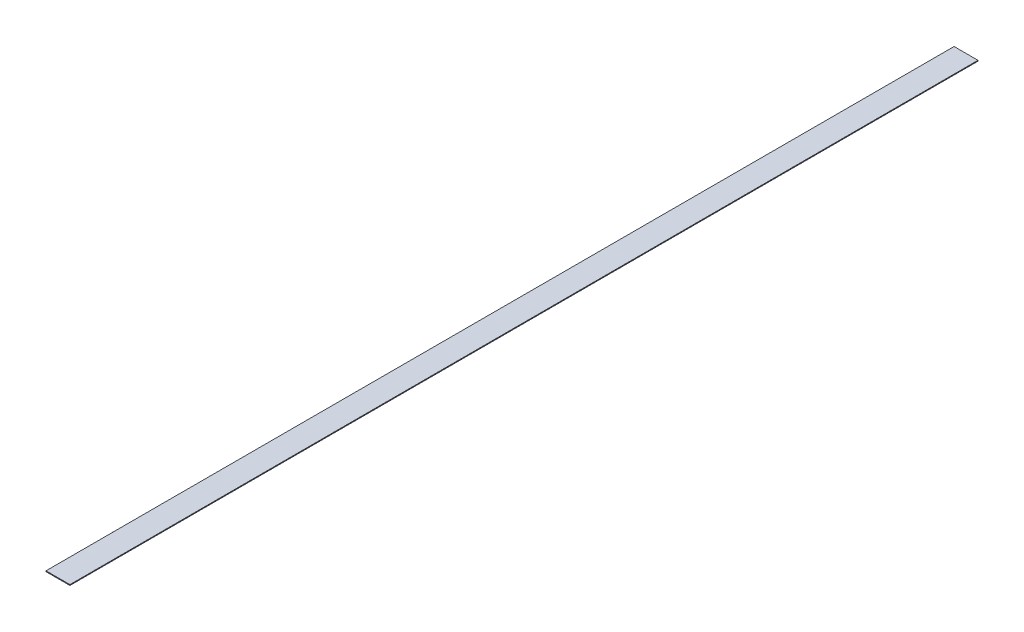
ISO-10303-21;
HEADER;
FILE_DESCRIPTION(('STEP AP214'),'2;1');
FILE_NAME('part.step','',(''),(''),'','','');
FILE_SCHEMA(('AUTOMOTIVE_DESIGN { 1 0 10303 214 1 1 1 1 }'));
ENDSEC;
DATA;
#1=APPLICATION_CONTEXT('core data for automotive mechanical design processes');
#2=APPLICATION_PROTOCOL_DEFINITION('international standard','automotive_design',2000,#1);
#3=PRODUCT_CONTEXT('',#1,'mechanical');
#4=PRODUCT('Part','Part','',(#3));
#5=PRODUCT_RELATED_PRODUCT_CATEGORY('part','',(#4));
#6=PRODUCT_DEFINITION_FORMATION('','',#4);
#7=PRODUCT_DEFINITION_CONTEXT('part definition',#1,'design');
#8=PRODUCT_DEFINITION('design','',#6,#7);
#9=PRODUCT_DEFINITION_SHAPE('','',#8);
#10=(LENGTH_UNIT() NAMED_UNIT(*) SI_UNIT(.MILLI.,.METRE.));
#11=(NAMED_UNIT(*) PLANE_ANGLE_UNIT() SI_UNIT($,.RADIAN.));
#12=(NAMED_UNIT(*) SI_UNIT($,.STERADIAN.) SOLID_ANGLE_UNIT());
#13=UNCERTAINTY_MEASURE_WITH_UNIT(LENGTH_MEASURE(1.E-05),#10,'distance_accuracy_value','');
#14=(GEOMETRIC_REPRESENTATION_CONTEXT(3) GLOBAL_UNCERTAINTY_ASSIGNED_CONTEXT((#13)) GLOBAL_UNIT_ASSIGNED_CONTEXT((#10,
#11,#12)) REPRESENTATION_CONTEXT('',''));
#15=CARTESIAN_POINT('',(0.,0.,0.));
#16=DIRECTION('',(0.,0.,1.));
#17=DIRECTION('',(1.,0.,0.));
#18=AXIS2_PLACEMENT_3D('',#15,#16,#17);
#19=CARTESIAN_POINT('',(0.,0.5,0.));
#20=DIRECTION('',(1.,0.,0.));
#21=DIRECTION('',(0.,0.,-1.));
#22=AXIS2_PLACEMENT_3D('',#19,#20,#21);
#23=PLANE('',#22);
#24=DIRECTION('',(0.,0.,1.));
#25=VECTOR('',#24,1.);
#26=CARTESIAN_POINT('',(0.,0.,0.));
#27=LINE('',#26,#25);
#28=CARTESIAN_POINT('',(0.,0.,-570.));
#29=VERTEX_POINT('',#28);
#30=CARTESIAN_POINT('',(0.,0.,0.));
#31=VERTEX_POINT('',#30);
#32=EDGE_CURVE('E70',#29,#31,#27,.T.);
#33=ORIENTED_EDGE('',*,*,#32,.T.);
#34=DIRECTION('',(0.,-1.,0.));
#35=VECTOR('',#34,1.);
#36=CARTESIAN_POINT('',(0.,0.5,0.));
#37=LINE('',#36,#35);
#38=CARTESIAN_POINT('',(0.,0.5,0.));
#39=VERTEX_POINT('',#38);
#40=EDGE_CURVE('E11',#39,#31,#37,.T.);
#41=ORIENTED_EDGE('',*,*,#40,.F.);
#42=DIRECTION('',(0.,0.,1.));
#43=VECTOR('',#42,1.);
#44=CARTESIAN_POINT('',(0.,0.5,0.));
#45=LINE('',#44,#43);
#46=CARTESIAN_POINT('',(0.,0.5,-570.));
#47=VERTEX_POINT('',#46);
#48=EDGE_CURVE('E88',#47,#39,#45,.T.);
#49=ORIENTED_EDGE('',*,*,#48,.F.);
#50=DIRECTION('',(0.,-1.,0.));
#51=VECTOR('',#50,1.);
#52=CARTESIAN_POINT('',(0.,0.5,-570.));
#53=LINE('',#52,#51);
#54=EDGE_CURVE('E82',#47,#29,#53,.T.);
#55=ORIENTED_EDGE('',*,*,#54,.T.);
#56=EDGE_LOOP('',(#33,#41,#49,#55));
#57=FACE_BOUND('',#56,.T.);
#58=ADVANCED_FACE('F26',(#57),#23,.F.);
#59=CARTESIAN_POINT('',(0.,0.5,0.));
#60=DIRECTION('',(0.,0.,-1.));
#61=DIRECTION('',(-1.,0.,0.));
#62=AXIS2_PLACEMENT_3D('',#59,#60,#61);
#63=PLANE('',#62);
#64=DIRECTION('',(1.,0.,0.));
#65=VECTOR('',#64,1.);
#66=CARTESIAN_POINT('',(0.,0.,0.));
#67=LINE('',#66,#65);
#68=CARTESIAN_POINT('',(15.,0.,0.));
#69=VERTEX_POINT('',#68);
#70=EDGE_CURVE('E66',#31,#69,#67,.T.);
#71=ORIENTED_EDGE('',*,*,#70,.T.);
#72=DIRECTION('',(0.,-1.,0.));
#73=VECTOR('',#72,1.);
#74=CARTESIAN_POINT('',(15.,0.5,0.));
#75=LINE('',#74,#73);
#76=CARTESIAN_POINT('',(15.,0.5,0.));
#77=VERTEX_POINT('',#76);
#78=EDGE_CURVE('E33',#77,#69,#75,.T.);
#79=ORIENTED_EDGE('',*,*,#78,.F.);
#80=DIRECTION('',(1.,0.,0.));
#81=VECTOR('',#80,1.);
#82=CARTESIAN_POINT('',(0.,0.5,0.));
#83=LINE('',#82,#81);
#84=EDGE_CURVE('E78',#39,#77,#83,.T.);
#85=ORIENTED_EDGE('',*,*,#84,.F.);
#86=ORIENTED_EDGE('',*,*,#40,.T.);
#87=EDGE_LOOP('',(#71,#79,#85,#86));
#88=FACE_BOUND('',#87,.T.);
#89=ADVANCED_FACE('F77',(#88),#63,.F.);
#90=CARTESIAN_POINT('',(15.,0.5,0.));
#91=DIRECTION('',(-1.,0.,0.));
#92=DIRECTION('',(0.,0.,1.));
#93=AXIS2_PLACEMENT_3D('',#90,#91,#92);
#94=PLANE('',#93);
#95=DIRECTION('',(0.,0.,-1.));
#96=VECTOR('',#95,1.);
#97=CARTESIAN_POINT('',(15.,0.,0.));
#98=LINE('',#97,#96);
#99=CARTESIAN_POINT('',(15.,0.,-570.));
#100=VERTEX_POINT('',#99);
#101=EDGE_CURVE('E71',#69,#100,#98,.T.);
#102=ORIENTED_EDGE('',*,*,#101,.T.);
#103=DIRECTION('',(0.,-1.,0.));
#104=VECTOR('',#103,1.);
#105=CARTESIAN_POINT('',(15.,0.5,-570.));
#106=LINE('',#105,#104);
#107=CARTESIAN_POINT('',(15.,0.5,-570.));
#108=VERTEX_POINT('',#107);
#109=EDGE_CURVE('E94',#108,#100,#106,.T.);
#110=ORIENTED_EDGE('',*,*,#109,.F.);
#111=DIRECTION('',(0.,0.,-1.));
#112=VECTOR('',#111,1.);
#113=CARTESIAN_POINT('',(15.,0.5,0.));
#114=LINE('',#113,#112);
#115=EDGE_CURVE('E45',#77,#108,#114,.T.);
#116=ORIENTED_EDGE('',*,*,#115,.F.);
#117=ORIENTED_EDGE('',*,*,#78,.T.);
#118=EDGE_LOOP('',(#102,#110,#116,#117));
#119=FACE_BOUND('',#118,.T.);
#120=ADVANCED_FACE('F97',(#119),#94,.F.);
#121=CARTESIAN_POINT('',(0.,0.5,-570.));
#122=DIRECTION('',(0.,0.,1.));
#123=DIRECTION('',(1.,0.,0.));
#124=AXIS2_PLACEMENT_3D('',#121,#122,#123);
#125=PLANE('',#124);
#126=DIRECTION('',(-1.,0.,0.));
#127=VECTOR('',#126,1.);
#128=CARTESIAN_POINT('',(0.,0.,-570.));
#129=LINE('',#128,#127);
#130=EDGE_CURVE('E86',#100,#29,#129,.T.);
#131=ORIENTED_EDGE('',*,*,#130,.T.);
#132=ORIENTED_EDGE('',*,*,#54,.F.);
#133=DIRECTION('',(-1.,0.,0.));
#134=VECTOR('',#133,1.);
#135=CARTESIAN_POINT('',(0.,0.5,-570.));
#136=LINE('',#135,#134);
#137=EDGE_CURVE('E40',#108,#47,#136,.T.);
#138=ORIENTED_EDGE('',*,*,#137,.F.);
#139=ORIENTED_EDGE('',*,*,#109,.T.);
#140=EDGE_LOOP('',(#131,#132,#138,#139));
#141=FACE_BOUND('',#140,.T.);
#142=ADVANCED_FACE('F99',(#141),#125,.F.);
#143=CARTESIAN_POINT('',(0.,0.5,-570.));
#144=DIRECTION('',(0.,-1.,0.));
#145=DIRECTION('',(0.,0.,-1.));
#146=AXIS2_PLACEMENT_3D('',#143,#144,#145);
#147=PLANE('',#146);
#148=ORIENTED_EDGE('',*,*,#48,.T.);
#149=ORIENTED_EDGE('',*,*,#84,.T.);
#150=ORIENTED_EDGE('',*,*,#115,.T.);
#151=ORIENTED_EDGE('',*,*,#137,.T.);
#152=EDGE_LOOP('',(#148,#149,#150,#151));
#153=FACE_BOUND('',#152,.T.);
#154=ADVANCED_FACE('F100',(#153),#147,.F.);
#155=CARTESIAN_POINT('',(0.,0.,-570.));
#156=DIRECTION('',(0.,-1.,0.));
#157=DIRECTION('',(0.,0.,-1.));
#158=AXIS2_PLACEMENT_3D('',#155,#156,#157);
#159=PLANE('',#158);
#160=ORIENTED_EDGE('',*,*,#32,.F.);
#161=ORIENTED_EDGE('',*,*,#130,.F.);
#162=ORIENTED_EDGE('',*,*,#101,.F.);
#163=ORIENTED_EDGE('',*,*,#70,.F.);
#164=EDGE_LOOP('',(#160,#161,#162,#163));
#165=FACE_BOUND('',#164,.T.);
#166=ADVANCED_FACE('F67',(#165),#159,.T.);
#167=CLOSED_SHELL('',(#58,#89,#120,#142,#154,#166));
#168=MANIFOLD_SOLID_BREP('B2',#167);
#169=ADVANCED_BREP_SHAPE_REPRESENTATION('',(#18,#168),#14);
#170=SHAPE_DEFINITION_REPRESENTATION(#9,#169);
ENDSEC;
END-ISO-10303-21;
